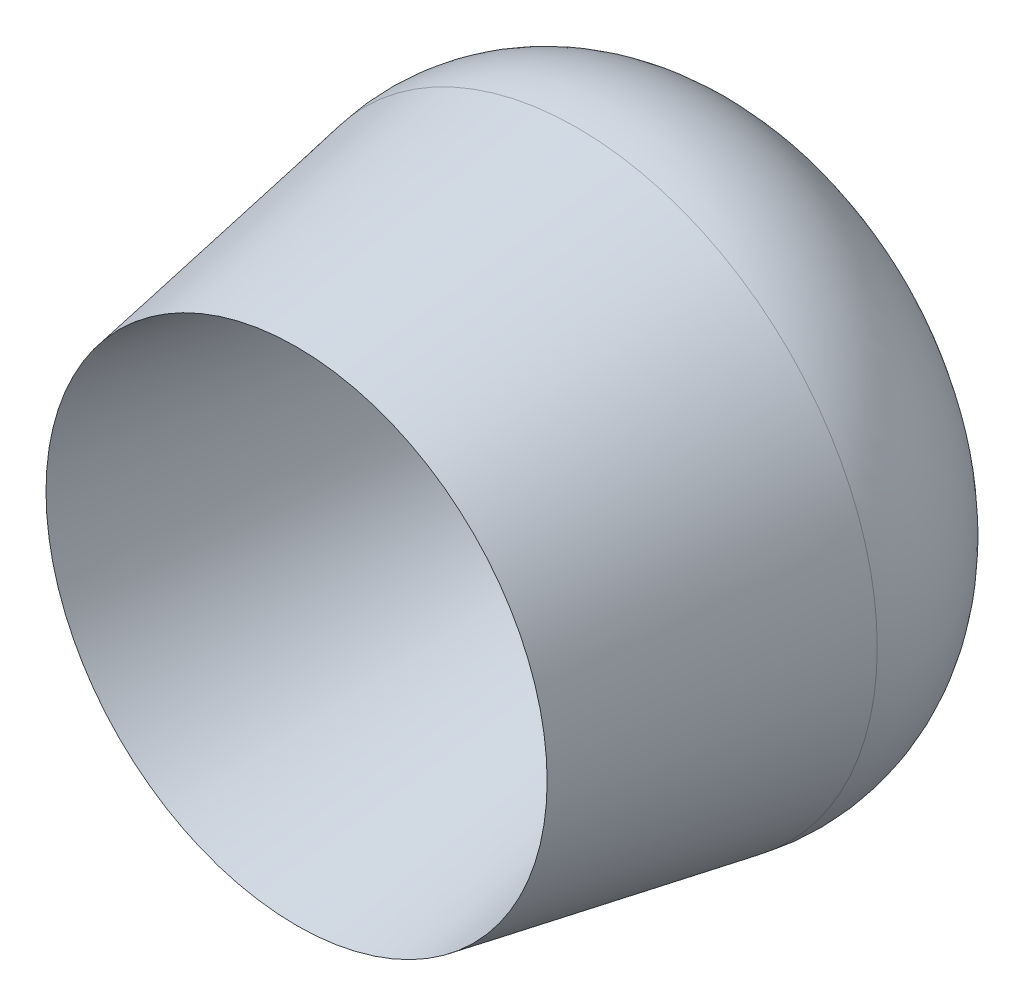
ISO-10303-21;
HEADER;
FILE_DESCRIPTION(('STEP AP214'),'2;1');
FILE_NAME('part.step','',(''),(''),'','','');
FILE_SCHEMA(('AUTOMOTIVE_DESIGN { 1 0 10303 214 1 1 1 1 }'));
ENDSEC;
DATA;
#1=APPLICATION_CONTEXT('core data for automotive mechanical design processes');
#2=APPLICATION_PROTOCOL_DEFINITION('international standard','automotive_design',2000,#1);
#3=PRODUCT_CONTEXT('',#1,'mechanical');
#4=PRODUCT('Part','Part','',(#3));
#5=PRODUCT_RELATED_PRODUCT_CATEGORY('part','',(#4));
#6=PRODUCT_DEFINITION_FORMATION('','',#4);
#7=PRODUCT_DEFINITION_CONTEXT('part definition',#1,'design');
#8=PRODUCT_DEFINITION('design','',#6,#7);
#9=PRODUCT_DEFINITION_SHAPE('','',#8);
#10=(LENGTH_UNIT() NAMED_UNIT(*) SI_UNIT(.MILLI.,.METRE.));
#11=(NAMED_UNIT(*) PLANE_ANGLE_UNIT() SI_UNIT($,.RADIAN.));
#12=(NAMED_UNIT(*) SI_UNIT($,.STERADIAN.) SOLID_ANGLE_UNIT());
#13=UNCERTAINTY_MEASURE_WITH_UNIT(LENGTH_MEASURE(1.E-05),#10,'distance_accuracy_value','');
#14=(GEOMETRIC_REPRESENTATION_CONTEXT(3) GLOBAL_UNCERTAINTY_ASSIGNED_CONTEXT((#13)) GLOBAL_UNIT_ASSIGNED_CONTEXT((#10,
#11,#12)) REPRESENTATION_CONTEXT('',''));
#15=CARTESIAN_POINT('',(0.,0.,0.));
#16=DIRECTION('',(0.,0.,1.));
#17=DIRECTION('',(1.,0.,0.));
#18=AXIS2_PLACEMENT_3D('',#15,#16,#17);
#19=CARTESIAN_POINT('',(0.,0.,0.));
#20=DIRECTION('',(0.,0.,1.));
#21=DIRECTION('',(1.,0.,0.));
#22=AXIS2_PLACEMENT_3D('',#19,#20,#21);
#23=CONICAL_SURFACE('',#22,1.,0.174532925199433);
#24=CARTESIAN_POINT('',(0.,0.,0.));
#25=DIRECTION('',(0.,0.,1.));
#26=DIRECTION('',(1.,0.,0.));
#27=AXIS2_PLACEMENT_3D('',#24,#25,#26);
#28=CIRCLE('',#27,1.);
#29=CARTESIAN_POINT('',(1.,0.,0.));
#30=VERTEX_POINT('',#29);
#31=EDGE_CURVE('E46',#30,#30,#28,.T.);
#32=ORIENTED_EDGE('',*,*,#31,.F.);
#33=EDGE_LOOP('',(#32));
#34=FACE_BOUND('',#33,.T.);
#35=CARTESIAN_POINT('',(0.,0.,2.83564090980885));
#36=DIRECTION('',(0.,0.,1.));
#37=DIRECTION('',(1.,0.,0.));
#38=AXIS2_PLACEMENT_3D('',#35,#36,#37);
#39=CIRCLE('',#38,1.5);
#40=CARTESIAN_POINT('',(1.5,0.,2.83564090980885));
#41=VERTEX_POINT('',#40);
#42=EDGE_CURVE('E42',#41,#41,#39,.T.);
#43=ORIENTED_EDGE('',*,*,#42,.T.);
#44=EDGE_LOOP('',(#43));
#45=FACE_BOUND('',#44,.T.);
#46=ADVANCED_FACE('F35',(#34,#45),#23,.F.);
#47=CARTESIAN_POINT('',(0.,0.,0.));
#48=DIRECTION('',(0.,0.,-1.));
#49=DIRECTION('',(1.,0.,0.));
#50=AXIS2_PLACEMENT_3D('',#47,#48,#49);
#51=CONICAL_SURFACE('',#50,2.,0.174532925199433);
#52=CARTESIAN_POINT('',(0.,0.,1.15570416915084));
#53=DIRECTION('',(0.,0.,1.));
#54=DIRECTION('',(1.,0.,0.));
#55=AXIS2_PLACEMENT_3D('',#52,#53,#54);
#56=CIRCLE('',#55,1.79621817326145);
#57=CARTESIAN_POINT('',(1.79621817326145,0.,1.15570416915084));
#58=VERTEX_POINT('',#57);
#59=EDGE_CURVE('E10',#58,#58,#56,.T.);
#60=ORIENTED_EDGE('',*,*,#59,.T.);
#61=EDGE_LOOP('',(#60));
#62=FACE_BOUND('',#61,.T.);
#63=ORIENTED_EDGE('',*,*,#42,.F.);
#64=EDGE_LOOP('',(#63));
#65=FACE_BOUND('',#64,.T.);
#66=ADVANCED_FACE('F56',(#62,#65),#51,.T.);
#67=CARTESIAN_POINT('',(0.,0.,0.982055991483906));
#68=DIRECTION('',(0.,0.,-1.));
#69=DIRECTION('',(-1.,0.,0.));
#70=AXIS2_PLACEMENT_3D('',#67,#68,#69);
#71=DEGENERATE_TOROIDAL_SURFACE('',#70,0.81141042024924,1.,.T.);
#72=ORIENTED_EDGE('',*,*,#31,.T.);
#73=EDGE_LOOP('',(#72));
#74=FACE_BOUND('',#73,.T.);
#75=ORIENTED_EDGE('',*,*,#59,.F.);
#76=EDGE_LOOP('',(#75));
#77=FACE_BOUND('',#76,.T.);
#78=ADVANCED_FACE('F37',(#74,#77),#71,.T.);
#79=CLOSED_SHELL('',(#46,#66,#78));
#80=MANIFOLD_SOLID_BREP('B2',#79);
#81=ADVANCED_BREP_SHAPE_REPRESENTATION('',(#18,#80),#14);
#82=SHAPE_DEFINITION_REPRESENTATION(#9,#81);
ENDSEC;
END-ISO-10303-21;
